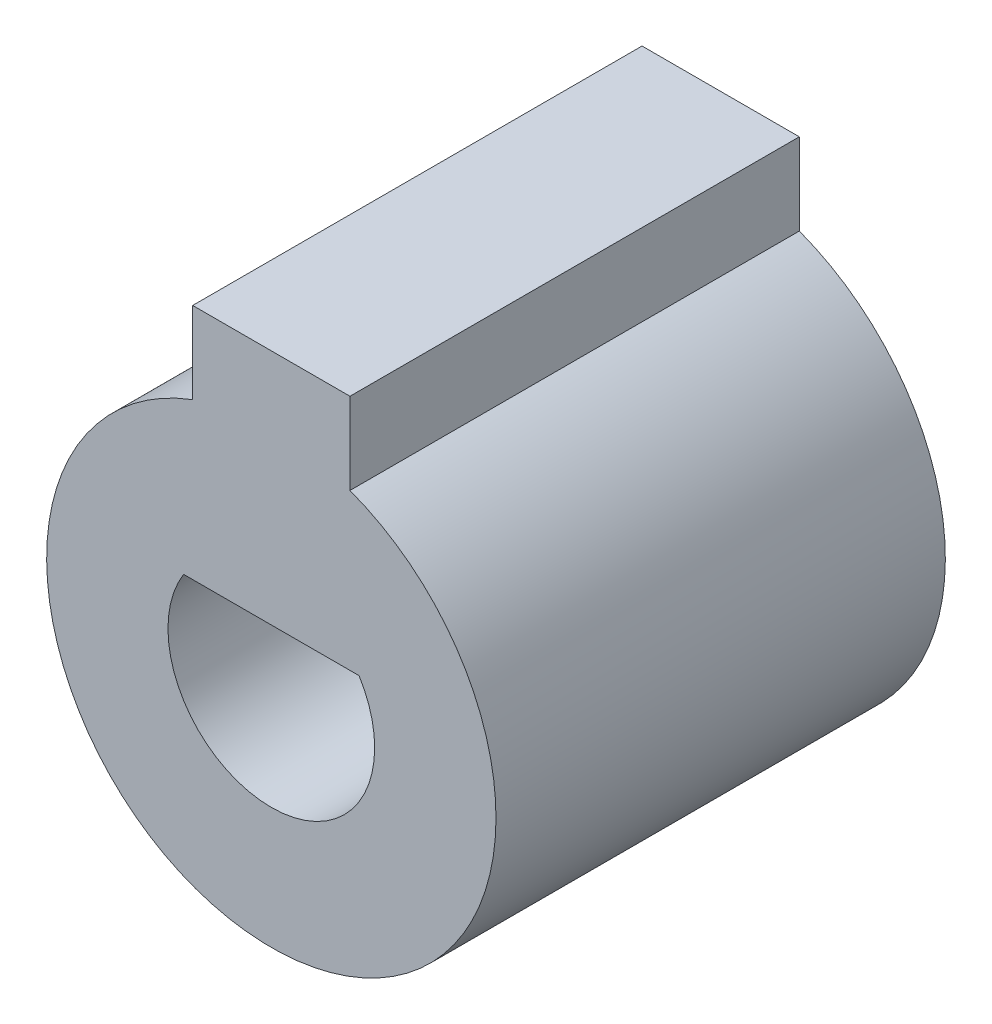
ISO-10303-21;
HEADER;
FILE_DESCRIPTION(('STEP AP214'),'2;1');
FILE_NAME('part.step','',(''),(''),'','','');
FILE_SCHEMA(('AUTOMOTIVE_DESIGN { 1 0 10303 214 1 1 1 1 }'));
ENDSEC;
DATA;
#1=APPLICATION_CONTEXT('core data for automotive mechanical design processes');
#2=APPLICATION_PROTOCOL_DEFINITION('international standard','automotive_design',2000,#1);
#3=PRODUCT_CONTEXT('',#1,'mechanical');
#4=PRODUCT('Part','Part','',(#3));
#5=PRODUCT_RELATED_PRODUCT_CATEGORY('part','',(#4));
#6=PRODUCT_DEFINITION_FORMATION('','',#4);
#7=PRODUCT_DEFINITION_CONTEXT('part definition',#1,'design');
#8=PRODUCT_DEFINITION('design','',#6,#7);
#9=PRODUCT_DEFINITION_SHAPE('','',#8);
#10=(LENGTH_UNIT() NAMED_UNIT(*) SI_UNIT(.MILLI.,.METRE.));
#11=(NAMED_UNIT(*) PLANE_ANGLE_UNIT() SI_UNIT($,.RADIAN.));
#12=(NAMED_UNIT(*) SI_UNIT($,.STERADIAN.) SOLID_ANGLE_UNIT());
#13=UNCERTAINTY_MEASURE_WITH_UNIT(LENGTH_MEASURE(1.E-05),#10,'distance_accuracy_value','');
#14=(GEOMETRIC_REPRESENTATION_CONTEXT(3) GLOBAL_UNCERTAINTY_ASSIGNED_CONTEXT((#13)) GLOBAL_UNIT_ASSIGNED_CONTEXT((#10,
#11,#12)) REPRESENTATION_CONTEXT('',''));
#15=CARTESIAN_POINT('',(0.,0.,0.));
#16=DIRECTION('',(0.,0.,1.));
#17=DIRECTION('',(1.,0.,0.));
#18=AXIS2_PLACEMENT_3D('',#15,#16,#17);
#19=CARTESIAN_POINT('',(0.,0.,10.));
#20=DIRECTION('',(0.,0.,-1.));
#21=DIRECTION('',(-1.,0.,0.));
#22=AXIS2_PLACEMENT_3D('',#19,#20,#21);
#23=CYLINDRICAL_SURFACE('',#22,2.3);
#24=CARTESIAN_POINT('',(0.,0.,0.));
#25=DIRECTION('',(0.,0.,1.));
#26=DIRECTION('',(1.,0.,0.));
#27=AXIS2_PLACEMENT_3D('',#24,#25,#26);
#28=CIRCLE('',#27,2.3);
#29=CARTESIAN_POINT('',(-1.95195478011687,1.21650011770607,0.));
#30=VERTEX_POINT('',#29);
#31=CARTESIAN_POINT('',(1.95195478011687,1.21650011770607,0.));
#32=VERTEX_POINT('',#31);
#33=EDGE_CURVE('E132',#30,#32,#28,.T.);
#34=ORIENTED_EDGE('',*,*,#33,.F.);
#35=DIRECTION('',(0.,0.,-1.));
#36=VECTOR('',#35,1.);
#37=CARTESIAN_POINT('',(-1.95195478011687,1.21650011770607,10.));
#38=LINE('',#37,#36);
#39=CARTESIAN_POINT('',(-1.95195478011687,1.21650011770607,10.));
#40=VERTEX_POINT('',#39);
#41=EDGE_CURVE('E11',#40,#30,#38,.T.);
#42=ORIENTED_EDGE('',*,*,#41,.F.);
#43=CARTESIAN_POINT('',(0.,0.,10.));
#44=DIRECTION('',(0.,0.,1.));
#45=DIRECTION('',(1.,0.,0.));
#46=AXIS2_PLACEMENT_3D('',#43,#44,#45);
#47=CIRCLE('',#46,2.3);
#48=CARTESIAN_POINT('',(1.95195478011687,1.21650011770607,10.));
#49=VERTEX_POINT('',#48);
#50=EDGE_CURVE('E117',#40,#49,#47,.T.);
#51=ORIENTED_EDGE('',*,*,#50,.T.);
#52=DIRECTION('',(0.,0.,-1.));
#53=VECTOR('',#52,1.);
#54=CARTESIAN_POINT('',(1.95195478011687,1.21650011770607,10.));
#55=LINE('',#54,#53);
#56=EDGE_CURVE('E49',#49,#32,#55,.T.);
#57=ORIENTED_EDGE('',*,*,#56,.T.);
#58=EDGE_LOOP('',(#34,#42,#51,#57));
#59=FACE_BOUND('',#58,.T.);
#60=ADVANCED_FACE('F39',(#59),#23,.F.);
#61=CARTESIAN_POINT('',(-1.75,0.,10.));
#62=DIRECTION('',(-1.,0.,0.));
#63=DIRECTION('',(0.,0.,1.));
#64=AXIS2_PLACEMENT_3D('',#61,#62,#63);
#65=PLANE('',#64);
#66=DIRECTION('',(0.,1.,0.));
#67=VECTOR('',#66,1.);
#68=CARTESIAN_POINT('',(-1.75,0.,0.));
#69=LINE('',#68,#67);
#70=CARTESIAN_POINT('',(-1.75,4.6837484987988,0.));
#71=VERTEX_POINT('',#70);
#72=CARTESIAN_POINT('',(-1.75,6.5,0.));
#73=VERTEX_POINT('',#72);
#74=EDGE_CURVE('E124',#71,#73,#69,.T.);
#75=ORIENTED_EDGE('',*,*,#74,.F.);
#76=DIRECTION('',(0.,0.,-1.));
#77=VECTOR('',#76,1.);
#78=CARTESIAN_POINT('',(-1.75,4.6837484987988,10.));
#79=LINE('',#78,#77);
#80=CARTESIAN_POINT('',(-1.75,4.6837484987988,10.));
#81=VERTEX_POINT('',#80);
#82=EDGE_CURVE('E43',#81,#71,#79,.T.);
#83=ORIENTED_EDGE('',*,*,#82,.F.);
#84=DIRECTION('',(0.,1.,0.));
#85=VECTOR('',#84,1.);
#86=CARTESIAN_POINT('',(-1.75,0.,10.));
#87=LINE('',#86,#85);
#88=CARTESIAN_POINT('',(-1.75,6.5,10.));
#89=VERTEX_POINT('',#88);
#90=EDGE_CURVE('E107',#81,#89,#87,.T.);
#91=ORIENTED_EDGE('',*,*,#90,.T.);
#92=DIRECTION('',(0.,0.,-1.));
#93=VECTOR('',#92,1.);
#94=CARTESIAN_POINT('',(-1.75,6.5,10.));
#95=LINE('',#94,#93);
#96=EDGE_CURVE('E96',#89,#73,#95,.T.);
#97=ORIENTED_EDGE('',*,*,#96,.T.);
#98=EDGE_LOOP('',(#75,#83,#91,#97));
#99=FACE_BOUND('',#98,.T.);
#100=ADVANCED_FACE('F41',(#99),#65,.T.);
#101=CARTESIAN_POINT('',(0.,0.,10.));
#102=DIRECTION('',(0.,0.,-1.));
#103=DIRECTION('',(-1.,0.,0.));
#104=AXIS2_PLACEMENT_3D('',#101,#102,#103);
#105=CYLINDRICAL_SURFACE('',#104,5.);
#106=CARTESIAN_POINT('',(0.,0.,0.));
#107=DIRECTION('',(0.,0.,1.));
#108=DIRECTION('',(1.,0.,0.));
#109=AXIS2_PLACEMENT_3D('',#106,#107,#108);
#110=CIRCLE('',#109,5.);
#111=CARTESIAN_POINT('',(1.75,4.6837484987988,0.));
#112=VERTEX_POINT('',#111);
#113=EDGE_CURVE('E126',#71,#112,#110,.T.);
#114=ORIENTED_EDGE('',*,*,#113,.T.);
#115=DIRECTION('',(0.,0.,-1.));
#116=VECTOR('',#115,1.);
#117=CARTESIAN_POINT('',(1.75,4.6837484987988,10.));
#118=LINE('',#117,#116);
#119=CARTESIAN_POINT('',(1.75,4.6837484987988,10.));
#120=VERTEX_POINT('',#119);
#121=EDGE_CURVE('E137',#120,#112,#118,.T.);
#122=ORIENTED_EDGE('',*,*,#121,.F.);
#123=CARTESIAN_POINT('',(0.,0.,10.));
#124=DIRECTION('',(0.,0.,1.));
#125=DIRECTION('',(1.,0.,0.));
#126=AXIS2_PLACEMENT_3D('',#123,#124,#125);
#127=CIRCLE('',#126,5.);
#128=EDGE_CURVE('E109',#81,#120,#127,.T.);
#129=ORIENTED_EDGE('',*,*,#128,.F.);
#130=ORIENTED_EDGE('',*,*,#82,.T.);
#131=EDGE_LOOP('',(#114,#122,#129,#130));
#132=FACE_BOUND('',#131,.T.);
#133=ADVANCED_FACE('F144',(#132),#105,.T.);
#134=CARTESIAN_POINT('',(1.75,0.,10.));
#135=DIRECTION('',(-1.,0.,0.));
#136=DIRECTION('',(0.,0.,1.));
#137=AXIS2_PLACEMENT_3D('',#134,#135,#136);
#138=PLANE('',#137);
#139=DIRECTION('',(0.,1.,0.));
#140=VECTOR('',#139,1.);
#141=CARTESIAN_POINT('',(1.75,0.,0.));
#142=LINE('',#141,#140);
#143=CARTESIAN_POINT('',(1.75,6.5,0.));
#144=VERTEX_POINT('',#143);
#145=EDGE_CURVE('E128',#112,#144,#142,.T.);
#146=ORIENTED_EDGE('',*,*,#145,.T.);
#147=DIRECTION('',(0.,0.,-1.));
#148=VECTOR('',#147,1.);
#149=CARTESIAN_POINT('',(1.75,6.5,10.));
#150=LINE('',#149,#148);
#151=CARTESIAN_POINT('',(1.75,6.5,10.));
#152=VERTEX_POINT('',#151);
#153=EDGE_CURVE('E103',#152,#144,#150,.T.);
#154=ORIENTED_EDGE('',*,*,#153,.F.);
#155=DIRECTION('',(0.,1.,0.));
#156=VECTOR('',#155,1.);
#157=CARTESIAN_POINT('',(1.75,0.,10.));
#158=LINE('',#157,#156);
#159=EDGE_CURVE('E115',#120,#152,#158,.T.);
#160=ORIENTED_EDGE('',*,*,#159,.F.);
#161=ORIENTED_EDGE('',*,*,#121,.T.);
#162=EDGE_LOOP('',(#146,#154,#160,#161));
#163=FACE_BOUND('',#162,.T.);
#164=ADVANCED_FACE('F148',(#163),#138,.F.);
#165=CARTESIAN_POINT('',(0.,6.5,10.));
#166=DIRECTION('',(0.,1.,0.));
#167=DIRECTION('',(0.,0.,1.));
#168=AXIS2_PLACEMENT_3D('',#165,#166,#167);
#169=PLANE('',#168);
#170=DIRECTION('',(1.,0.,0.));
#171=VECTOR('',#170,1.);
#172=CARTESIAN_POINT('',(0.,6.5,0.));
#173=LINE('',#172,#171);
#174=EDGE_CURVE('E101',#73,#144,#173,.T.);
#175=ORIENTED_EDGE('',*,*,#174,.F.);
#176=ORIENTED_EDGE('',*,*,#96,.F.);
#177=DIRECTION('',(1.,0.,0.));
#178=VECTOR('',#177,1.);
#179=CARTESIAN_POINT('',(0.,6.5,10.));
#180=LINE('',#179,#178);
#181=EDGE_CURVE('E99',#89,#152,#180,.T.);
#182=ORIENTED_EDGE('',*,*,#181,.T.);
#183=ORIENTED_EDGE('',*,*,#153,.T.);
#184=EDGE_LOOP('',(#175,#176,#182,#183));
#185=FACE_BOUND('',#184,.T.);
#186=ADVANCED_FACE('F97',(#185),#169,.T.);
#187=CARTESIAN_POINT('',(0.,1.21650011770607,10.));
#188=DIRECTION('',(0.,-1.,0.));
#189=DIRECTION('',(0.,0.,-1.));
#190=AXIS2_PLACEMENT_3D('',#187,#188,#189);
#191=PLANE('',#190);
#192=DIRECTION('',(-1.,0.,0.));
#193=VECTOR('',#192,1.);
#194=CARTESIAN_POINT('',(0.,1.21650011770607,0.));
#195=LINE('',#194,#193);
#196=EDGE_CURVE('E110',#32,#30,#195,.T.);
#197=ORIENTED_EDGE('',*,*,#196,.F.);
#198=ORIENTED_EDGE('',*,*,#56,.F.);
#199=DIRECTION('',(-1.,0.,0.));
#200=VECTOR('',#199,1.);
#201=CARTESIAN_POINT('',(0.,1.21650011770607,10.));
#202=LINE('',#201,#200);
#203=EDGE_CURVE('E104',#49,#40,#202,.T.);
#204=ORIENTED_EDGE('',*,*,#203,.T.);
#205=ORIENTED_EDGE('',*,*,#41,.T.);
#206=EDGE_LOOP('',(#197,#198,#204,#205));
#207=FACE_BOUND('',#206,.T.);
#208=ADVANCED_FACE('F155',(#207),#191,.T.);
#209=CARTESIAN_POINT('',(0.,0.,10.));
#210=DIRECTION('',(0.,0.,1.));
#211=DIRECTION('',(1.,0.,0.));
#212=AXIS2_PLACEMENT_3D('',#209,#210,#211);
#213=PLANE('',#212);
#214=ORIENTED_EDGE('',*,*,#90,.F.);
#215=ORIENTED_EDGE('',*,*,#128,.T.);
#216=ORIENTED_EDGE('',*,*,#159,.T.);
#217=ORIENTED_EDGE('',*,*,#181,.F.);
#218=EDGE_LOOP('',(#214,#215,#216,#217));
#219=FACE_BOUND('',#218,.T.);
#220=ORIENTED_EDGE('',*,*,#50,.F.);
#221=ORIENTED_EDGE('',*,*,#203,.F.);
#222=EDGE_LOOP('',(#220,#221));
#223=FACE_BOUND('',#222,.T.);
#224=ADVANCED_FACE('F112',(#219,#223),#213,.T.);
#225=CARTESIAN_POINT('',(0.,0.,0.));
#226=DIRECTION('',(0.,0.,1.));
#227=DIRECTION('',(1.,0.,0.));
#228=AXIS2_PLACEMENT_3D('',#225,#226,#227);
#229=PLANE('',#228);
#230=ORIENTED_EDGE('',*,*,#74,.T.);
#231=ORIENTED_EDGE('',*,*,#174,.T.);
#232=ORIENTED_EDGE('',*,*,#145,.F.);
#233=ORIENTED_EDGE('',*,*,#113,.F.);
#234=EDGE_LOOP('',(#230,#231,#232,#233));
#235=FACE_BOUND('',#234,.T.);
#236=ORIENTED_EDGE('',*,*,#33,.T.);
#237=ORIENTED_EDGE('',*,*,#196,.T.);
#238=EDGE_LOOP('',(#236,#237));
#239=FACE_BOUND('',#238,.T.);
#240=ADVANCED_FACE('F146',(#235,#239),#229,.F.);
#241=CLOSED_SHELL('',(#60,#100,#133,#164,#186,#208,#224,#240));
#242=MANIFOLD_SOLID_BREP('B2',#241);
#243=ADVANCED_BREP_SHAPE_REPRESENTATION('',(#18,#242),#14);
#244=SHAPE_DEFINITION_REPRESENTATION(#9,#243);
ENDSEC;
END-ISO-10303-21;
